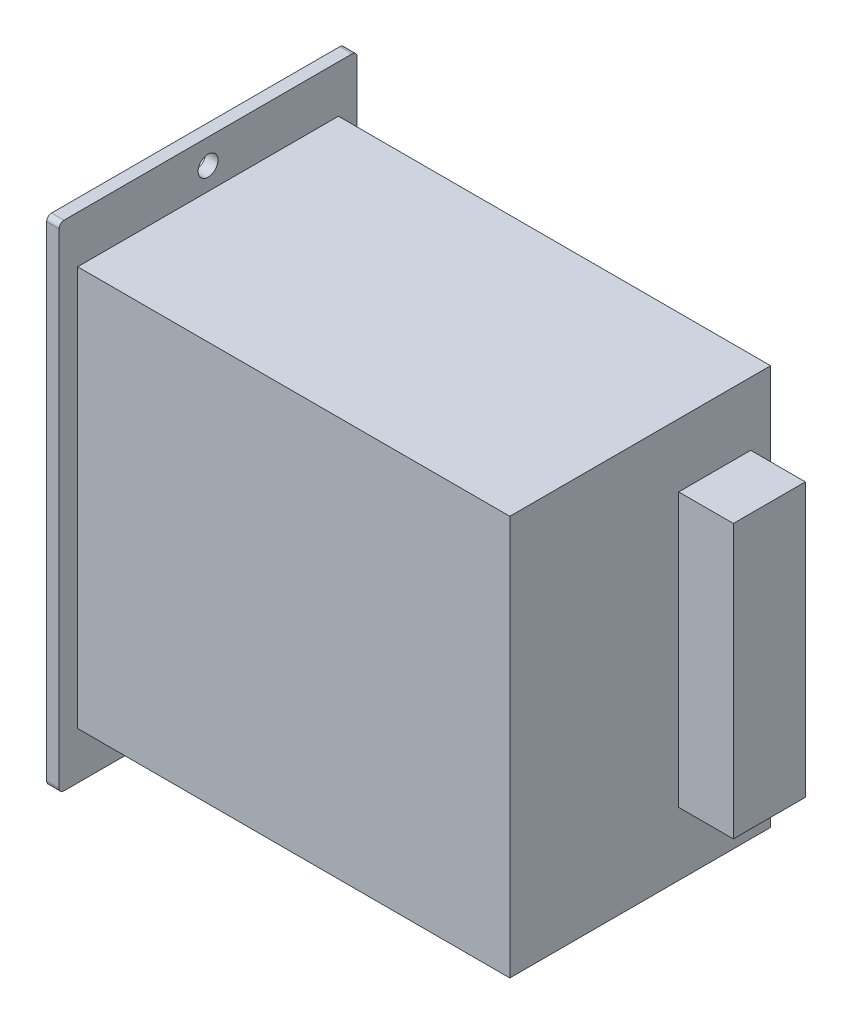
ISO-10303-21;
HEADER;
FILE_DESCRIPTION(('STEP AP214'),'2;1');
FILE_NAME('part.step','',(''),(''),'','','');
FILE_SCHEMA(('AUTOMOTIVE_DESIGN { 1 0 10303 214 1 1 1 1 }'));
ENDSEC;
DATA;
#1=APPLICATION_CONTEXT('core data for automotive mechanical design processes');
#2=APPLICATION_PROTOCOL_DEFINITION('international standard','automotive_design',2000,#1);
#3=PRODUCT_CONTEXT('',#1,'mechanical');
#4=PRODUCT('Part','Part','',(#3));
#5=PRODUCT_RELATED_PRODUCT_CATEGORY('part','',(#4));
#6=PRODUCT_DEFINITION_FORMATION('','',#4);
#7=PRODUCT_DEFINITION_CONTEXT('part definition',#1,'design');
#8=PRODUCT_DEFINITION('design','',#6,#7);
#9=PRODUCT_DEFINITION_SHAPE('','',#8);
#10=(LENGTH_UNIT() NAMED_UNIT(*) SI_UNIT(.MILLI.,.METRE.));
#11=(NAMED_UNIT(*) PLANE_ANGLE_UNIT() SI_UNIT($,.RADIAN.));
#12=(NAMED_UNIT(*) SI_UNIT($,.STERADIAN.) SOLID_ANGLE_UNIT());
#13=UNCERTAINTY_MEASURE_WITH_UNIT(LENGTH_MEASURE(1.E-05),#10,'distance_accuracy_value','');
#14=(GEOMETRIC_REPRESENTATION_CONTEXT(3) GLOBAL_UNCERTAINTY_ASSIGNED_CONTEXT((#13)) GLOBAL_UNIT_ASSIGNED_CONTEXT((#10,
#11,#12)) REPRESENTATION_CONTEXT('',''));
#15=CARTESIAN_POINT('',(0.,0.,0.));
#16=DIRECTION('',(0.,0.,1.));
#17=DIRECTION('',(1.,0.,0.));
#18=AXIS2_PLACEMENT_3D('',#15,#16,#17);
#19=CARTESIAN_POINT('',(0.,0.,0.));
#20=DIRECTION('',(-1.,0.,0.));
#21=DIRECTION('',(0.,0.,1.));
#22=AXIS2_PLACEMENT_3D('',#19,#20,#21);
#23=PLANE('',#22);
#24=CARTESIAN_POINT('',(0.,-44.75,0.));
#25=DIRECTION('',(-1.,0.,0.));
#26=DIRECTION('',(0.,0.,1.));
#27=AXIS2_PLACEMENT_3D('',#24,#25,#26);
#28=CIRCLE('',#27,2.5);
#29=CARTESIAN_POINT('',(0.,-44.75,2.5));
#30=VERTEX_POINT('',#29);
#31=EDGE_CURVE('E343',#30,#30,#28,.T.);
#32=ORIENTED_EDGE('',*,*,#31,.F.);
#33=EDGE_LOOP('',(#32));
#34=FACE_BOUND('',#33,.T.);
#35=CARTESIAN_POINT('',(0.,44.75,0.));
#36=DIRECTION('',(-1.,0.,0.));
#37=DIRECTION('',(0.,0.,1.));
#38=AXIS2_PLACEMENT_3D('',#35,#36,#37);
#39=CIRCLE('',#38,2.);
#40=CARTESIAN_POINT('',(0.,44.75,2.));
#41=VERTEX_POINT('',#40);
#42=EDGE_CURVE('E202',#41,#41,#39,.T.);
#43=ORIENTED_EDGE('',*,*,#42,.F.);
#44=EDGE_LOOP('',(#43));
#45=FACE_BOUND('',#44,.T.);
#46=DIRECTION('',(0.,1.,0.));
#47=VECTOR('',#46,1.);
#48=CARTESIAN_POINT('',(0.,-49.75,-30.));
#49=LINE('',#48,#47);
#50=CARTESIAN_POINT('',(0.,-48.75,-30.));
#51=VERTEX_POINT('',#50);
#52=CARTESIAN_POINT('',(0.,48.75,-30.));
#53=VERTEX_POINT('',#52);
#54=EDGE_CURVE('E274',#51,#53,#49,.T.);
#55=ORIENTED_EDGE('',*,*,#54,.F.);
#56=CARTESIAN_POINT('',(0.,-48.75,-29.));
#57=DIRECTION('',(-1.,0.,0.));
#58=DIRECTION('',(0.,0.,1.));
#59=AXIS2_PLACEMENT_3D('',#56,#57,#58);
#60=CIRCLE('',#59,1.);
#61=CARTESIAN_POINT('',(0.,-49.75,-29.));
#62=VERTEX_POINT('',#61);
#63=EDGE_CURVE('E317',#51,#62,#60,.T.);
#64=ORIENTED_EDGE('',*,*,#63,.T.);
#65=DIRECTION('',(0.,0.,-1.));
#66=VECTOR('',#65,1.);
#67=CARTESIAN_POINT('',(0.,-49.75,30.));
#68=LINE('',#67,#66);
#69=CARTESIAN_POINT('',(0.,-49.75,29.));
#70=VERTEX_POINT('',#69);
#71=EDGE_CURVE('E279',#70,#62,#68,.T.);
#72=ORIENTED_EDGE('',*,*,#71,.F.);
#73=CARTESIAN_POINT('',(0.,-48.75,29.));
#74=DIRECTION('',(-1.,0.,0.));
#75=DIRECTION('',(0.,0.,1.));
#76=AXIS2_PLACEMENT_3D('',#73,#74,#75);
#77=CIRCLE('',#76,1.);
#78=CARTESIAN_POINT('',(0.,-48.75,30.));
#79=VERTEX_POINT('',#78);
#80=EDGE_CURVE('E315',#70,#79,#77,.T.);
#81=ORIENTED_EDGE('',*,*,#80,.T.);
#82=DIRECTION('',(0.,-1.,0.));
#83=VECTOR('',#82,1.);
#84=CARTESIAN_POINT('',(0.,-49.75,30.));
#85=LINE('',#84,#83);
#86=CARTESIAN_POINT('',(0.,48.75,30.));
#87=VERTEX_POINT('',#86);
#88=EDGE_CURVE('E292',#87,#79,#85,.T.);
#89=ORIENTED_EDGE('',*,*,#88,.F.);
#90=CARTESIAN_POINT('',(0.,48.75,29.));
#91=DIRECTION('',(-1.,0.,0.));
#92=DIRECTION('',(0.,0.,1.));
#93=AXIS2_PLACEMENT_3D('',#90,#91,#92);
#94=CIRCLE('',#93,1.);
#95=CARTESIAN_POINT('',(0.,49.75,29.));
#96=VERTEX_POINT('',#95);
#97=EDGE_CURVE('E313',#87,#96,#94,.T.);
#98=ORIENTED_EDGE('',*,*,#97,.T.);
#99=DIRECTION('',(0.,0.,1.));
#100=VECTOR('',#99,1.);
#101=CARTESIAN_POINT('',(0.,49.75,30.));
#102=LINE('',#101,#100);
#103=CARTESIAN_POINT('',(0.,49.75,-29.));
#104=VERTEX_POINT('',#103);
#105=EDGE_CURVE('E289',#104,#96,#102,.T.);
#106=ORIENTED_EDGE('',*,*,#105,.F.);
#107=CARTESIAN_POINT('',(0.,48.75,-29.));
#108=DIRECTION('',(-1.,0.,0.));
#109=DIRECTION('',(0.,0.,1.));
#110=AXIS2_PLACEMENT_3D('',#107,#108,#109);
#111=CIRCLE('',#110,1.);
#112=EDGE_CURVE('E311',#104,#53,#111,.T.);
#113=ORIENTED_EDGE('',*,*,#112,.T.);
#114=EDGE_LOOP('',(#55,#64,#72,#81,#89,#98,#106,#113));
#115=FACE_BOUND('',#114,.T.);
#116=DIRECTION('',(0.,0.,-1.));
#117=VECTOR('',#116,1.);
#118=CARTESIAN_POINT('',(0.,40.25,-28.75));
#119=LINE('',#118,#117);
#120=CARTESIAN_POINT('',(0.,40.25,28.75));
#121=VERTEX_POINT('',#120);
#122=CARTESIAN_POINT('',(0.,40.25,-28.75));
#123=VERTEX_POINT('',#122);
#124=EDGE_CURVE('E174',#121,#123,#119,.T.);
#125=ORIENTED_EDGE('',*,*,#124,.F.);
#126=DIRECTION('',(0.,1.,0.));
#127=VECTOR('',#126,1.);
#128=CARTESIAN_POINT('',(0.,-40.25,28.75));
#129=LINE('',#128,#127);
#130=CARTESIAN_POINT('',(0.,-40.25,28.75));
#131=VERTEX_POINT('',#130);
#132=EDGE_CURVE('E178',#131,#121,#129,.T.);
#133=ORIENTED_EDGE('',*,*,#132,.F.);
#134=DIRECTION('',(0.,0.,1.));
#135=VECTOR('',#134,1.);
#136=CARTESIAN_POINT('',(0.,-40.25,-28.75));
#137=LINE('',#136,#135);
#138=CARTESIAN_POINT('',(0.,-40.25,-28.75));
#139=VERTEX_POINT('',#138);
#140=EDGE_CURVE('E206',#139,#131,#137,.T.);
#141=ORIENTED_EDGE('',*,*,#140,.F.);
#142=DIRECTION('',(0.,-1.,0.));
#143=VECTOR('',#142,1.);
#144=CARTESIAN_POINT('',(0.,-40.25,-28.75));
#145=LINE('',#144,#143);
#146=EDGE_CURVE('E181',#123,#139,#145,.T.);
#147=ORIENTED_EDGE('',*,*,#146,.F.);
#148=EDGE_LOOP('',(#125,#133,#141,#147));
#149=FACE_BOUND('',#148,.T.);
#150=ADVANCED_FACE('F35',(#34,#45,#115,#149),#23,.T.);
#151=CARTESIAN_POINT('',(89.5,0.,0.));
#152=DIRECTION('',(-1.,0.,0.));
#153=DIRECTION('',(0.,0.,1.));
#154=AXIS2_PLACEMENT_3D('',#151,#152,#153);
#155=PLANE('',#154);
#156=DIRECTION('',(0.,1.,0.));
#157=VECTOR('',#156,1.);
#158=CARTESIAN_POINT('',(89.5,-40.25,-26.25));
#159=LINE('',#158,#157);
#160=CARTESIAN_POINT('',(89.5,-40.25,-26.25));
#161=VERTEX_POINT('',#160);
#162=CARTESIAN_POINT('',(89.5,40.25,-26.25));
#163=VERTEX_POINT('',#162);
#164=EDGE_CURVE('E242',#161,#163,#159,.T.);
#165=ORIENTED_EDGE('',*,*,#164,.T.);
#166=DIRECTION('',(0.,0.,1.));
#167=VECTOR('',#166,1.);
#168=CARTESIAN_POINT('',(89.5,40.25,26.25));
#169=LINE('',#168,#167);
#170=CARTESIAN_POINT('',(89.5,40.25,26.25));
#171=VERTEX_POINT('',#170);
#172=EDGE_CURVE('E245',#163,#171,#169,.T.);
#173=ORIENTED_EDGE('',*,*,#172,.T.);
#174=DIRECTION('',(0.,-1.,0.));
#175=VECTOR('',#174,1.);
#176=CARTESIAN_POINT('',(89.5,-40.25,26.25));
#177=LINE('',#176,#175);
#178=CARTESIAN_POINT('',(89.5,-40.25,26.25));
#179=VERTEX_POINT('',#178);
#180=EDGE_CURVE('E248',#171,#179,#177,.T.);
#181=ORIENTED_EDGE('',*,*,#180,.T.);
#182=DIRECTION('',(0.,0.,-1.));
#183=VECTOR('',#182,1.);
#184=CARTESIAN_POINT('',(89.5,-40.25,26.25));
#185=LINE('',#184,#183);
#186=EDGE_CURVE('E250',#179,#161,#185,.T.);
#187=ORIENTED_EDGE('',*,*,#186,.T.);
#188=EDGE_LOOP('',(#165,#173,#181,#187));
#189=FACE_BOUND('',#188,.T.);
#190=DIRECTION('',(0.,1.,0.));
#191=VECTOR('',#190,1.);
#192=CARTESIAN_POINT('',(89.5,-27.5,-22.25));
#193=LINE('',#192,#191);
#194=CARTESIAN_POINT('',(89.5,-27.5,-22.25));
#195=VERTEX_POINT('',#194);
#196=CARTESIAN_POINT('',(89.5,27.5,-22.25));
#197=VERTEX_POINT('',#196);
#198=EDGE_CURVE('E208',#195,#197,#193,.T.);
#199=ORIENTED_EDGE('',*,*,#198,.F.);
#200=DIRECTION('',(0.,0.,-1.));
#201=VECTOR('',#200,1.);
#202=CARTESIAN_POINT('',(89.5,-27.5,-7.75000000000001));
#203=LINE('',#202,#201);
#204=CARTESIAN_POINT('',(89.5,-27.5,-7.75000000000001));
#205=VERTEX_POINT('',#204);
#206=EDGE_CURVE('E213',#205,#195,#203,.T.);
#207=ORIENTED_EDGE('',*,*,#206,.F.);
#208=DIRECTION('',(0.,-1.,0.));
#209=VECTOR('',#208,1.);
#210=CARTESIAN_POINT('',(89.5,27.5,-7.75));
#211=LINE('',#210,#209);
#212=CARTESIAN_POINT('',(89.5,27.5,-7.75));
#213=VERTEX_POINT('',#212);
#214=EDGE_CURVE('E225',#213,#205,#211,.T.);
#215=ORIENTED_EDGE('',*,*,#214,.F.);
#216=DIRECTION('',(0.,0.,1.));
#217=VECTOR('',#216,1.);
#218=CARTESIAN_POINT('',(89.5,27.5,-22.25));
#219=LINE('',#218,#217);
#220=EDGE_CURVE('E222',#197,#213,#219,.T.);
#221=ORIENTED_EDGE('',*,*,#220,.F.);
#222=EDGE_LOOP('',(#199,#207,#215,#221));
#223=FACE_BOUND('',#222,.T.);
#224=ADVANCED_FACE('F354',(#189,#223),#155,.F.);
#225=CARTESIAN_POINT('',(2.5,0.,0.));
#226=DIRECTION('',(-1.,0.,0.));
#227=DIRECTION('',(0.,0.,1.));
#228=AXIS2_PLACEMENT_3D('',#225,#226,#227);
#229=PLANE('',#228);
#230=CARTESIAN_POINT('',(2.5,-44.75,0.));
#231=DIRECTION('',(-1.,0.,0.));
#232=DIRECTION('',(0.,0.,1.));
#233=AXIS2_PLACEMENT_3D('',#230,#231,#232);
#234=CIRCLE('',#233,2.5);
#235=CARTESIAN_POINT('',(2.5,-44.75,2.5));
#236=VERTEX_POINT('',#235);
#237=EDGE_CURVE('E39',#236,#236,#234,.T.);
#238=ORIENTED_EDGE('',*,*,#237,.T.);
#239=EDGE_LOOP('',(#238));
#240=FACE_BOUND('',#239,.T.);
#241=CARTESIAN_POINT('',(2.5,44.75,0.));
#242=DIRECTION('',(-1.,0.,0.));
#243=DIRECTION('',(0.,0.,1.));
#244=AXIS2_PLACEMENT_3D('',#241,#242,#243);
#245=CIRCLE('',#244,2.);
#246=CARTESIAN_POINT('',(2.5,44.75,2.));
#247=VERTEX_POINT('',#246);
#248=EDGE_CURVE('E305',#247,#247,#245,.T.);
#249=ORIENTED_EDGE('',*,*,#248,.T.);
#250=EDGE_LOOP('',(#249));
#251=FACE_BOUND('',#250,.T.);
#252=DIRECTION('',(0.,0.,-1.));
#253=VECTOR('',#252,1.);
#254=CARTESIAN_POINT('',(2.5,-49.75,30.));
#255=LINE('',#254,#253);
#256=CARTESIAN_POINT('',(2.5,-49.75,29.));
#257=VERTEX_POINT('',#256);
#258=CARTESIAN_POINT('',(2.5,-49.75,-29.));
#259=VERTEX_POINT('',#258);
#260=EDGE_CURVE('E283',#257,#259,#255,.T.);
#261=ORIENTED_EDGE('',*,*,#260,.T.);
#262=CARTESIAN_POINT('',(2.5,-48.75,-29.));
#263=DIRECTION('',(-1.,0.,0.));
#264=DIRECTION('',(0.,0.,1.));
#265=AXIS2_PLACEMENT_3D('',#262,#263,#264);
#266=CIRCLE('',#265,1.);
#267=CARTESIAN_POINT('',(2.5,-48.75,-30.));
#268=VERTEX_POINT('',#267);
#269=EDGE_CURVE('E329',#259,#268,#266,.F.);
#270=ORIENTED_EDGE('',*,*,#269,.T.);
#271=DIRECTION('',(0.,1.,0.));
#272=VECTOR('',#271,1.);
#273=CARTESIAN_POINT('',(2.5,-49.75,-30.));
#274=LINE('',#273,#272);
#275=CARTESIAN_POINT('',(2.5,48.75,-30.));
#276=VERTEX_POINT('',#275);
#277=EDGE_CURVE('E275',#268,#276,#274,.T.);
#278=ORIENTED_EDGE('',*,*,#277,.T.);
#279=CARTESIAN_POINT('',(2.5,48.75,-29.));
#280=DIRECTION('',(-1.,0.,0.));
#281=DIRECTION('',(0.,0.,1.));
#282=AXIS2_PLACEMENT_3D('',#279,#280,#281);
#283=CIRCLE('',#282,1.);
#284=CARTESIAN_POINT('',(2.5,49.75,-29.));
#285=VERTEX_POINT('',#284);
#286=EDGE_CURVE('E324',#276,#285,#283,.F.);
#287=ORIENTED_EDGE('',*,*,#286,.T.);
#288=DIRECTION('',(0.,0.,1.));
#289=VECTOR('',#288,1.);
#290=CARTESIAN_POINT('',(2.5,49.75,30.));
#291=LINE('',#290,#289);
#292=CARTESIAN_POINT('',(2.5,49.75,29.));
#293=VERTEX_POINT('',#292);
#294=EDGE_CURVE('E278',#285,#293,#291,.T.);
#295=ORIENTED_EDGE('',*,*,#294,.T.);
#296=CARTESIAN_POINT('',(2.5,48.75,29.));
#297=DIRECTION('',(-1.,0.,0.));
#298=DIRECTION('',(0.,0.,1.));
#299=AXIS2_PLACEMENT_3D('',#296,#297,#298);
#300=CIRCLE('',#299,1.);
#301=CARTESIAN_POINT('',(2.5,48.75,30.));
#302=VERTEX_POINT('',#301);
#303=EDGE_CURVE('E59',#293,#302,#300,.F.);
#304=ORIENTED_EDGE('',*,*,#303,.T.);
#305=DIRECTION('',(0.,-1.,0.));
#306=VECTOR('',#305,1.);
#307=CARTESIAN_POINT('',(2.5,-49.75,30.));
#308=LINE('',#307,#306);
#309=CARTESIAN_POINT('',(2.5,-48.75,30.));
#310=VERTEX_POINT('',#309);
#311=EDGE_CURVE('E281',#302,#310,#308,.T.);
#312=ORIENTED_EDGE('',*,*,#311,.T.);
#313=CARTESIAN_POINT('',(2.5,-48.75,29.));
#314=DIRECTION('',(-1.,0.,0.));
#315=DIRECTION('',(0.,0.,1.));
#316=AXIS2_PLACEMENT_3D('',#313,#314,#315);
#317=CIRCLE('',#316,1.);
#318=EDGE_CURVE('E327',#310,#257,#317,.F.);
#319=ORIENTED_EDGE('',*,*,#318,.T.);
#320=EDGE_LOOP('',(#261,#270,#278,#287,#295,#304,#312,#319));
#321=FACE_BOUND('',#320,.T.);
#322=DIRECTION('',(0.,1.,0.));
#323=VECTOR('',#322,1.);
#324=CARTESIAN_POINT('',(2.5,-40.25,-26.25));
#325=LINE('',#324,#323);
#326=CARTESIAN_POINT('',(2.5,-40.25,-26.25));
#327=VERTEX_POINT('',#326);
#328=CARTESIAN_POINT('',(2.5,40.25,-26.25));
#329=VERTEX_POINT('',#328);
#330=EDGE_CURVE('E241',#327,#329,#325,.T.);
#331=ORIENTED_EDGE('',*,*,#330,.F.);
#332=DIRECTION('',(0.,0.,-1.));
#333=VECTOR('',#332,1.);
#334=CARTESIAN_POINT('',(2.5,-40.25,26.25));
#335=LINE('',#334,#333);
#336=CARTESIAN_POINT('',(2.5,-40.25,26.25));
#337=VERTEX_POINT('',#336);
#338=EDGE_CURVE('E246',#337,#327,#335,.T.);
#339=ORIENTED_EDGE('',*,*,#338,.F.);
#340=DIRECTION('',(0.,-1.,0.));
#341=VECTOR('',#340,1.);
#342=CARTESIAN_POINT('',(2.5,-40.25,26.25));
#343=LINE('',#342,#341);
#344=CARTESIAN_POINT('',(2.5,40.25,26.25));
#345=VERTEX_POINT('',#344);
#346=EDGE_CURVE('E258',#345,#337,#343,.T.);
#347=ORIENTED_EDGE('',*,*,#346,.F.);
#348=DIRECTION('',(0.,0.,1.));
#349=VECTOR('',#348,1.);
#350=CARTESIAN_POINT('',(2.5,40.25,26.25));
#351=LINE('',#350,#349);
#352=EDGE_CURVE('E255',#329,#345,#351,.T.);
#353=ORIENTED_EDGE('',*,*,#352,.F.);
#354=EDGE_LOOP('',(#331,#339,#347,#353));
#355=FACE_BOUND('',#354,.T.);
#356=ADVANCED_FACE('F369',(#240,#251,#321,#355),#229,.F.);
#357=CARTESIAN_POINT('',(2.5,-49.75,-30.));
#358=DIRECTION('',(0.,0.,1.));
#359=DIRECTION('',(1.,0.,0.));
#360=AXIS2_PLACEMENT_3D('',#357,#358,#359);
#361=PLANE('',#360);
#362=ORIENTED_EDGE('',*,*,#277,.F.);
#363=DIRECTION('',(-1.,0.,0.));
#364=VECTOR('',#363,1.);
#365=CARTESIAN_POINT('',(2.5,-48.75,-30.));
#366=LINE('',#365,#364);
#367=EDGE_CURVE('E308',#268,#51,#366,.T.);
#368=ORIENTED_EDGE('',*,*,#367,.T.);
#369=ORIENTED_EDGE('',*,*,#54,.T.);
#370=DIRECTION('',(-1.,0.,0.));
#371=VECTOR('',#370,1.);
#372=CARTESIAN_POINT('',(2.5,48.75,-30.));
#373=LINE('',#372,#371);
#374=EDGE_CURVE('E303',#53,#276,#373,.F.);
#375=ORIENTED_EDGE('',*,*,#374,.T.);
#376=EDGE_LOOP('',(#362,#368,#369,#375));
#377=FACE_BOUND('',#376,.T.);
#378=ADVANCED_FACE('F363',(#377),#361,.F.);
#379=CARTESIAN_POINT('',(2.5,49.75,30.));
#380=DIRECTION('',(0.,-1.,0.));
#381=DIRECTION('',(0.,0.,-1.));
#382=AXIS2_PLACEMENT_3D('',#379,#380,#381);
#383=PLANE('',#382);
#384=ORIENTED_EDGE('',*,*,#105,.T.);
#385=DIRECTION('',(-1.,0.,0.));
#386=VECTOR('',#385,1.);
#387=CARTESIAN_POINT('',(2.5,49.75,29.));
#388=LINE('',#387,#386);
#389=EDGE_CURVE('E11',#96,#293,#388,.F.);
#390=ORIENTED_EDGE('',*,*,#389,.T.);
#391=ORIENTED_EDGE('',*,*,#294,.F.);
#392=DIRECTION('',(-1.,0.,0.));
#393=VECTOR('',#392,1.);
#394=CARTESIAN_POINT('',(2.5,49.75,-29.));
#395=LINE('',#394,#393);
#396=EDGE_CURVE('E44',#285,#104,#395,.T.);
#397=ORIENTED_EDGE('',*,*,#396,.T.);
#398=EDGE_LOOP('',(#384,#390,#391,#397));
#399=FACE_BOUND('',#398,.T.);
#400=ADVANCED_FACE('F372',(#399),#383,.F.);
#401=CARTESIAN_POINT('',(2.5,-49.75,30.));
#402=DIRECTION('',(0.,0.,-1.));
#403=DIRECTION('',(-1.,0.,0.));
#404=AXIS2_PLACEMENT_3D('',#401,#402,#403);
#405=PLANE('',#404);
#406=ORIENTED_EDGE('',*,*,#88,.T.);
#407=DIRECTION('',(-1.,0.,0.));
#408=VECTOR('',#407,1.);
#409=CARTESIAN_POINT('',(2.5,-48.75,30.));
#410=LINE('',#409,#408);
#411=EDGE_CURVE('E52',#79,#310,#410,.F.);
#412=ORIENTED_EDGE('',*,*,#411,.T.);
#413=ORIENTED_EDGE('',*,*,#311,.F.);
#414=DIRECTION('',(-1.,0.,0.));
#415=VECTOR('',#414,1.);
#416=CARTESIAN_POINT('',(2.5,48.75,30.));
#417=LINE('',#416,#415);
#418=EDGE_CURVE('E331',#302,#87,#417,.T.);
#419=ORIENTED_EDGE('',*,*,#418,.T.);
#420=EDGE_LOOP('',(#406,#412,#413,#419));
#421=FACE_BOUND('',#420,.T.);
#422=ADVANCED_FACE('F378',(#421),#405,.F.);
#423=CARTESIAN_POINT('',(2.5,-49.75,30.));
#424=DIRECTION('',(0.,1.,0.));
#425=DIRECTION('',(0.,0.,1.));
#426=AXIS2_PLACEMENT_3D('',#423,#424,#425);
#427=PLANE('',#426);
#428=ORIENTED_EDGE('',*,*,#71,.T.);
#429=DIRECTION('',(-1.,0.,0.));
#430=VECTOR('',#429,1.);
#431=CARTESIAN_POINT('',(2.5,-49.75,-29.));
#432=LINE('',#431,#430);
#433=EDGE_CURVE('E322',#62,#259,#432,.F.);
#434=ORIENTED_EDGE('',*,*,#433,.T.);
#435=ORIENTED_EDGE('',*,*,#260,.F.);
#436=DIRECTION('',(-1.,0.,0.));
#437=VECTOR('',#436,1.);
#438=CARTESIAN_POINT('',(2.5,-49.75,29.));
#439=LINE('',#438,#437);
#440=EDGE_CURVE('E319',#257,#70,#439,.T.);
#441=ORIENTED_EDGE('',*,*,#440,.T.);
#442=EDGE_LOOP('',(#428,#434,#435,#441));
#443=FACE_BOUND('',#442,.T.);
#444=ADVANCED_FACE('F385',(#443),#427,.F.);
#445=CARTESIAN_POINT('',(89.5,-40.25,-26.25));
#446=DIRECTION('',(0.,0.,1.));
#447=DIRECTION('',(1.,0.,0.));
#448=AXIS2_PLACEMENT_3D('',#445,#446,#447);
#449=PLANE('',#448);
#450=ORIENTED_EDGE('',*,*,#330,.T.);
#451=DIRECTION('',(-1.,0.,0.));
#452=VECTOR('',#451,1.);
#453=CARTESIAN_POINT('',(89.5,40.25,-26.25));
#454=LINE('',#453,#452);
#455=EDGE_CURVE('E271',#163,#329,#454,.T.);
#456=ORIENTED_EDGE('',*,*,#455,.F.);
#457=ORIENTED_EDGE('',*,*,#164,.F.);
#458=DIRECTION('',(-1.,0.,0.));
#459=VECTOR('',#458,1.);
#460=CARTESIAN_POINT('',(89.5,-40.25,-26.25));
#461=LINE('',#460,#459);
#462=EDGE_CURVE('E252',#161,#327,#461,.T.);
#463=ORIENTED_EDGE('',*,*,#462,.T.);
#464=EDGE_LOOP('',(#450,#456,#457,#463));
#465=FACE_BOUND('',#464,.T.);
#466=ADVANCED_FACE('F455',(#465),#449,.F.);
#467=CARTESIAN_POINT('',(89.5,40.25,26.25));
#468=DIRECTION('',(0.,-1.,0.));
#469=DIRECTION('',(0.,0.,-1.));
#470=AXIS2_PLACEMENT_3D('',#467,#468,#469);
#471=PLANE('',#470);
#472=ORIENTED_EDGE('',*,*,#352,.T.);
#473=DIRECTION('',(-1.,0.,0.));
#474=VECTOR('',#473,1.);
#475=CARTESIAN_POINT('',(89.5,40.25,26.25));
#476=LINE('',#475,#474);
#477=EDGE_CURVE('E268',#171,#345,#476,.T.);
#478=ORIENTED_EDGE('',*,*,#477,.F.);
#479=ORIENTED_EDGE('',*,*,#172,.F.);
#480=ORIENTED_EDGE('',*,*,#455,.T.);
#481=EDGE_LOOP('',(#472,#478,#479,#480));
#482=FACE_BOUND('',#481,.T.);
#483=ADVANCED_FACE('F451',(#482),#471,.F.);
#484=CARTESIAN_POINT('',(89.5,-40.25,26.25));
#485=DIRECTION('',(0.,0.,-1.));
#486=DIRECTION('',(-1.,0.,0.));
#487=AXIS2_PLACEMENT_3D('',#484,#485,#486);
#488=PLANE('',#487);
#489=ORIENTED_EDGE('',*,*,#346,.T.);
#490=DIRECTION('',(-1.,0.,0.));
#491=VECTOR('',#490,1.);
#492=CARTESIAN_POINT('',(89.5,-40.25,26.25));
#493=LINE('',#492,#491);
#494=EDGE_CURVE('E265',#179,#337,#493,.T.);
#495=ORIENTED_EDGE('',*,*,#494,.F.);
#496=ORIENTED_EDGE('',*,*,#180,.F.);
#497=ORIENTED_EDGE('',*,*,#477,.T.);
#498=EDGE_LOOP('',(#489,#495,#496,#497));
#499=FACE_BOUND('',#498,.T.);
#500=ADVANCED_FACE('F447',(#499),#488,.F.);
#501=CARTESIAN_POINT('',(89.5,-40.25,26.25));
#502=DIRECTION('',(0.,1.,0.));
#503=DIRECTION('',(0.,0.,1.));
#504=AXIS2_PLACEMENT_3D('',#501,#502,#503);
#505=PLANE('',#504);
#506=ORIENTED_EDGE('',*,*,#338,.T.);
#507=ORIENTED_EDGE('',*,*,#462,.F.);
#508=ORIENTED_EDGE('',*,*,#186,.F.);
#509=ORIENTED_EDGE('',*,*,#494,.T.);
#510=EDGE_LOOP('',(#506,#507,#508,#509));
#511=FACE_BOUND('',#510,.T.);
#512=ADVANCED_FACE('F440',(#511),#505,.F.);
#513=CARTESIAN_POINT('',(100.5,-27.5,-22.25));
#514=DIRECTION('',(0.,0.,1.));
#515=DIRECTION('',(1.,0.,0.));
#516=AXIS2_PLACEMENT_3D('',#513,#514,#515);
#517=PLANE('',#516);
#518=ORIENTED_EDGE('',*,*,#198,.T.);
#519=DIRECTION('',(-1.,0.,0.));
#520=VECTOR('',#519,1.);
#521=CARTESIAN_POINT('',(100.5,27.5,-22.25));
#522=LINE('',#521,#520);
#523=CARTESIAN_POINT('',(100.5,27.5,-22.25));
#524=VERTEX_POINT('',#523);
#525=EDGE_CURVE('E238',#524,#197,#522,.T.);
#526=ORIENTED_EDGE('',*,*,#525,.F.);
#527=DIRECTION('',(0.,1.,0.));
#528=VECTOR('',#527,1.);
#529=CARTESIAN_POINT('',(100.5,-27.5,-22.25));
#530=LINE('',#529,#528);
#531=CARTESIAN_POINT('',(100.5,-27.5,-22.25));
#532=VERTEX_POINT('',#531);
#533=EDGE_CURVE('E209',#532,#524,#530,.T.);
#534=ORIENTED_EDGE('',*,*,#533,.F.);
#535=DIRECTION('',(-1.,0.,0.));
#536=VECTOR('',#535,1.);
#537=CARTESIAN_POINT('',(100.5,-27.5,-22.25));
#538=LINE('',#537,#536);
#539=EDGE_CURVE('E219',#532,#195,#538,.T.);
#540=ORIENTED_EDGE('',*,*,#539,.T.);
#541=EDGE_LOOP('',(#518,#526,#534,#540));
#542=FACE_BOUND('',#541,.T.);
#543=ADVANCED_FACE('F436',(#542),#517,.F.);
#544=CARTESIAN_POINT('',(100.5,27.5,-22.25));
#545=DIRECTION('',(0.,-1.,0.));
#546=DIRECTION('',(0.,0.,-1.));
#547=AXIS2_PLACEMENT_3D('',#544,#545,#546);
#548=PLANE('',#547);
#549=ORIENTED_EDGE('',*,*,#220,.T.);
#550=DIRECTION('',(-1.,0.,0.));
#551=VECTOR('',#550,1.);
#552=CARTESIAN_POINT('',(100.5,27.5,-7.75));
#553=LINE('',#552,#551);
#554=CARTESIAN_POINT('',(100.5,27.5,-7.75));
#555=VERTEX_POINT('',#554);
#556=EDGE_CURVE('E235',#555,#213,#553,.T.);
#557=ORIENTED_EDGE('',*,*,#556,.F.);
#558=DIRECTION('',(0.,0.,1.));
#559=VECTOR('',#558,1.);
#560=CARTESIAN_POINT('',(100.5,27.5,-22.25));
#561=LINE('',#560,#559);
#562=EDGE_CURVE('E212',#524,#555,#561,.T.);
#563=ORIENTED_EDGE('',*,*,#562,.F.);
#564=ORIENTED_EDGE('',*,*,#525,.T.);
#565=EDGE_LOOP('',(#549,#557,#563,#564));
#566=FACE_BOUND('',#565,.T.);
#567=ADVANCED_FACE('F432',(#566),#548,.F.);
#568=CARTESIAN_POINT('',(100.5,27.5,-7.75));
#569=DIRECTION('',(0.,0.,-1.));
#570=DIRECTION('',(0.,1.,0.));
#571=AXIS2_PLACEMENT_3D('',#568,#569,#570);
#572=PLANE('',#571);
#573=ORIENTED_EDGE('',*,*,#214,.T.);
#574=DIRECTION('',(-1.,0.,0.));
#575=VECTOR('',#574,1.);
#576=CARTESIAN_POINT('',(100.5,-27.5,-7.75000000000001));
#577=LINE('',#576,#575);
#578=CARTESIAN_POINT('',(100.5,-27.5,-7.75000000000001));
#579=VERTEX_POINT('',#578);
#580=EDGE_CURVE('E232',#579,#205,#577,.T.);
#581=ORIENTED_EDGE('',*,*,#580,.F.);
#582=DIRECTION('',(0.,-1.,0.));
#583=VECTOR('',#582,1.);
#584=CARTESIAN_POINT('',(100.5,27.5,-7.75));
#585=LINE('',#584,#583);
#586=EDGE_CURVE('E215',#555,#579,#585,.T.);
#587=ORIENTED_EDGE('',*,*,#586,.F.);
#588=ORIENTED_EDGE('',*,*,#556,.T.);
#589=EDGE_LOOP('',(#573,#581,#587,#588));
#590=FACE_BOUND('',#589,.T.);
#591=ADVANCED_FACE('F428',(#590),#572,.F.);
#592=CARTESIAN_POINT('',(100.5,-27.5,-7.75000000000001));
#593=DIRECTION('',(0.,1.,0.));
#594=DIRECTION('',(0.,0.,1.));
#595=AXIS2_PLACEMENT_3D('',#592,#593,#594);
#596=PLANE('',#595);
#597=ORIENTED_EDGE('',*,*,#206,.T.);
#598=ORIENTED_EDGE('',*,*,#539,.F.);
#599=DIRECTION('',(0.,0.,-1.));
#600=VECTOR('',#599,1.);
#601=CARTESIAN_POINT('',(100.5,-27.5,-7.75000000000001));
#602=LINE('',#601,#600);
#603=EDGE_CURVE('E217',#579,#532,#602,.T.);
#604=ORIENTED_EDGE('',*,*,#603,.F.);
#605=ORIENTED_EDGE('',*,*,#580,.T.);
#606=EDGE_LOOP('',(#597,#598,#604,#605));
#607=FACE_BOUND('',#606,.T.);
#608=ADVANCED_FACE('F424',(#607),#596,.F.);
#609=CARTESIAN_POINT('',(100.5,0.,0.));
#610=DIRECTION('',(1.,0.,0.));
#611=DIRECTION('',(0.,0.,-1.));
#612=AXIS2_PLACEMENT_3D('',#609,#610,#611);
#613=PLANE('',#612);
#614=ORIENTED_EDGE('',*,*,#533,.T.);
#615=ORIENTED_EDGE('',*,*,#562,.T.);
#616=ORIENTED_EDGE('',*,*,#586,.T.);
#617=ORIENTED_EDGE('',*,*,#603,.T.);
#618=EDGE_LOOP('',(#614,#615,#616,#617));
#619=FACE_BOUND('',#618,.T.);
#620=ADVANCED_FACE('F420',(#619),#613,.T.);
#621=CARTESIAN_POINT('',(-1.,0.,0.));
#622=DIRECTION('',(1.,0.,0.));
#623=DIRECTION('',(0.,0.,-1.));
#624=AXIS2_PLACEMENT_3D('',#621,#622,#623);
#625=PLANE('',#624);
#626=DIRECTION('',(0.,-1.,0.));
#627=VECTOR('',#626,1.);
#628=CARTESIAN_POINT('',(-1.,0.,-27.75));
#629=LINE('',#628,#627);
#630=CARTESIAN_POINT('',(-1.,39.25,-27.75));
#631=VERTEX_POINT('',#630);
#632=CARTESIAN_POINT('',(-1.,-39.25,-27.75));
#633=VERTEX_POINT('',#632);
#634=EDGE_CURVE('E298',#631,#633,#629,.T.);
#635=ORIENTED_EDGE('',*,*,#634,.T.);
#636=DIRECTION('',(0.,0.,1.));
#637=VECTOR('',#636,1.);
#638=CARTESIAN_POINT('',(-1.,-39.25,0.));
#639=LINE('',#638,#637);
#640=CARTESIAN_POINT('',(-1.,-39.25,27.75));
#641=VERTEX_POINT('',#640);
#642=EDGE_CURVE('E300',#633,#641,#639,.T.);
#643=ORIENTED_EDGE('',*,*,#642,.T.);
#644=DIRECTION('',(0.,1.,0.));
#645=VECTOR('',#644,1.);
#646=CARTESIAN_POINT('',(-1.,0.,27.75));
#647=LINE('',#646,#645);
#648=CARTESIAN_POINT('',(-1.,39.25,27.75));
#649=VERTEX_POINT('',#648);
#650=EDGE_CURVE('E286',#641,#649,#647,.T.);
#651=ORIENTED_EDGE('',*,*,#650,.T.);
#652=DIRECTION('',(0.,0.,-1.));
#653=VECTOR('',#652,1.);
#654=CARTESIAN_POINT('',(-1.,39.25,0.));
#655=LINE('',#654,#653);
#656=EDGE_CURVE('E190',#649,#631,#655,.T.);
#657=ORIENTED_EDGE('',*,*,#656,.T.);
#658=EDGE_LOOP('',(#635,#643,#651,#657));
#659=FACE_BOUND('',#658,.T.);
#660=ADVANCED_FACE('F417',(#659),#625,.F.);
#661=CARTESIAN_POINT('',(-1.,39.25,0.));
#662=DIRECTION('',(0.707106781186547,-0.707106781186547,0.));
#663=DIRECTION('',(0.,0.,-1.));
#664=AXIS2_PLACEMENT_3D('',#661,#662,#663);
#665=PLANE('',#664);
#666=DIRECTION('',(-0.577350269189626,-0.577350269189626,-0.577350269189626));
#667=VECTOR('',#666,1.);
#668=CARTESIAN_POINT('',(-14.0833333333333,26.1666666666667,14.6666666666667));
#669=LINE('',#668,#667);
#670=EDGE_CURVE('E188',#121,#649,#669,.T.);
#671=ORIENTED_EDGE('',*,*,#670,.F.);
#672=ORIENTED_EDGE('',*,*,#124,.T.);
#673=DIRECTION('',(-0.577350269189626,-0.577350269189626,0.577350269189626));
#674=VECTOR('',#673,1.);
#675=CARTESIAN_POINT('',(-10.25,30.,-18.5));
#676=LINE('',#675,#674);
#677=EDGE_CURVE('E193',#631,#123,#676,.F.);
#678=ORIENTED_EDGE('',*,*,#677,.F.);
#679=ORIENTED_EDGE('',*,*,#656,.F.);
#680=EDGE_LOOP('',(#671,#672,#678,#679));
#681=FACE_BOUND('',#680,.T.);
#682=ADVANCED_FACE('F189',(#681),#665,.F.);
#683=CARTESIAN_POINT('',(-1.,0.,-27.75));
#684=DIRECTION('',(0.707106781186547,0.,0.707106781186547));
#685=DIRECTION('',(0.,-1.,0.));
#686=AXIS2_PLACEMENT_3D('',#683,#684,#685);
#687=PLANE('',#686);
#688=ORIENTED_EDGE('',*,*,#677,.T.);
#689=ORIENTED_EDGE('',*,*,#146,.T.);
#690=DIRECTION('',(-0.577350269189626,0.577350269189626,0.577350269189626));
#691=VECTOR('',#690,1.);
#692=CARTESIAN_POINT('',(-14.0833333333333,-26.1666666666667,-14.6666666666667));
#693=LINE('',#692,#691);
#694=EDGE_CURVE('E194',#633,#139,#693,.F.);
#695=ORIENTED_EDGE('',*,*,#694,.F.);
#696=ORIENTED_EDGE('',*,*,#634,.F.);
#697=EDGE_LOOP('',(#688,#689,#695,#696));
#698=FACE_BOUND('',#697,.T.);
#699=ADVANCED_FACE('F471',(#698),#687,.F.);
#700=CARTESIAN_POINT('',(-1.,0.,27.75));
#701=DIRECTION('',(0.707106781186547,0.,-0.707106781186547));
#702=DIRECTION('',(0.,1.,0.));
#703=AXIS2_PLACEMENT_3D('',#700,#701,#702);
#704=PLANE('',#703);
#705=ORIENTED_EDGE('',*,*,#670,.T.);
#706=ORIENTED_EDGE('',*,*,#650,.F.);
#707=DIRECTION('',(0.577350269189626,-0.577350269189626,0.577350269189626));
#708=VECTOR('',#707,1.);
#709=CARTESIAN_POINT('',(-14.0833333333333,-26.1666666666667,14.6666666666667));
#710=LINE('',#709,#708);
#711=EDGE_CURVE('E198',#131,#641,#710,.F.);
#712=ORIENTED_EDGE('',*,*,#711,.F.);
#713=ORIENTED_EDGE('',*,*,#132,.T.);
#714=EDGE_LOOP('',(#705,#706,#712,#713));
#715=FACE_BOUND('',#714,.T.);
#716=ADVANCED_FACE('F197',(#715),#704,.F.);
#717=CARTESIAN_POINT('',(-1.,-39.25,0.));
#718=DIRECTION('',(0.707106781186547,0.707106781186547,0.));
#719=DIRECTION('',(0.,0.,1.));
#720=AXIS2_PLACEMENT_3D('',#717,#718,#719);
#721=PLANE('',#720);
#722=ORIENTED_EDGE('',*,*,#694,.T.);
#723=ORIENTED_EDGE('',*,*,#140,.T.);
#724=ORIENTED_EDGE('',*,*,#711,.T.);
#725=ORIENTED_EDGE('',*,*,#642,.F.);
#726=EDGE_LOOP('',(#722,#723,#724,#725));
#727=FACE_BOUND('',#726,.T.);
#728=ADVANCED_FACE('F391',(#727),#721,.F.);
#729=CARTESIAN_POINT('',(2.5,-48.75,-29.));
#730=DIRECTION('',(-1.,0.,0.));
#731=DIRECTION('',(0.,0.,1.));
#732=AXIS2_PLACEMENT_3D('',#729,#730,#731);
#733=CYLINDRICAL_SURFACE('',#732,1.);
#734=ORIENTED_EDGE('',*,*,#269,.F.);
#735=ORIENTED_EDGE('',*,*,#433,.F.);
#736=ORIENTED_EDGE('',*,*,#63,.F.);
#737=ORIENTED_EDGE('',*,*,#367,.F.);
#738=EDGE_LOOP('',(#734,#735,#736,#737));
#739=FACE_BOUND('',#738,.T.);
#740=ADVANCED_FACE('F389',(#739),#733,.T.);
#741=CARTESIAN_POINT('',(2.5,-48.75,29.));
#742=DIRECTION('',(-1.,0.,0.));
#743=DIRECTION('',(0.,0.,1.));
#744=AXIS2_PLACEMENT_3D('',#741,#742,#743);
#745=CYLINDRICAL_SURFACE('',#744,1.);
#746=ORIENTED_EDGE('',*,*,#318,.F.);
#747=ORIENTED_EDGE('',*,*,#411,.F.);
#748=ORIENTED_EDGE('',*,*,#80,.F.);
#749=ORIENTED_EDGE('',*,*,#440,.F.);
#750=EDGE_LOOP('',(#746,#747,#748,#749));
#751=FACE_BOUND('',#750,.T.);
#752=ADVANCED_FACE('F382',(#751),#745,.T.);
#753=CARTESIAN_POINT('',(2.5,48.75,29.));
#754=DIRECTION('',(-1.,0.,0.));
#755=DIRECTION('',(0.,0.,1.));
#756=AXIS2_PLACEMENT_3D('',#753,#754,#755);
#757=CYLINDRICAL_SURFACE('',#756,1.);
#758=ORIENTED_EDGE('',*,*,#303,.F.);
#759=ORIENTED_EDGE('',*,*,#389,.F.);
#760=ORIENTED_EDGE('',*,*,#97,.F.);
#761=ORIENTED_EDGE('',*,*,#418,.F.);
#762=EDGE_LOOP('',(#758,#759,#760,#761));
#763=FACE_BOUND('',#762,.T.);
#764=ADVANCED_FACE('F375',(#763),#757,.T.);
#765=CARTESIAN_POINT('',(2.5,48.75,-29.));
#766=DIRECTION('',(-1.,0.,0.));
#767=DIRECTION('',(0.,0.,1.));
#768=AXIS2_PLACEMENT_3D('',#765,#766,#767);
#769=CYLINDRICAL_SURFACE('',#768,1.);
#770=ORIENTED_EDGE('',*,*,#286,.F.);
#771=ORIENTED_EDGE('',*,*,#374,.F.);
#772=ORIENTED_EDGE('',*,*,#112,.F.);
#773=ORIENTED_EDGE('',*,*,#396,.F.);
#774=EDGE_LOOP('',(#770,#771,#772,#773));
#775=FACE_BOUND('',#774,.T.);
#776=ADVANCED_FACE('F37',(#775),#769,.T.);
#777=CARTESIAN_POINT('',(3.,44.75,0.));
#778=DIRECTION('',(-1.,0.,0.));
#779=DIRECTION('',(0.,0.,1.));
#780=AXIS2_PLACEMENT_3D('',#777,#778,#779);
#781=CYLINDRICAL_SURFACE('',#780,2.);
#782=ORIENTED_EDGE('',*,*,#42,.T.);
#783=EDGE_LOOP('',(#782));
#784=FACE_BOUND('',#783,.T.);
#785=ORIENTED_EDGE('',*,*,#248,.F.);
#786=EDGE_LOOP('',(#785));
#787=FACE_BOUND('',#786,.T.);
#788=ADVANCED_FACE('F406',(#784,#787),#781,.F.);
#789=CARTESIAN_POINT('',(3.,-44.75,0.));
#790=DIRECTION('',(-1.,0.,0.));
#791=DIRECTION('',(0.,0.,1.));
#792=AXIS2_PLACEMENT_3D('',#789,#790,#791);
#793=CYLINDRICAL_SURFACE('',#792,2.5);
#794=ORIENTED_EDGE('',*,*,#31,.T.);
#795=EDGE_LOOP('',(#794));
#796=FACE_BOUND('',#795,.T.);
#797=ORIENTED_EDGE('',*,*,#237,.F.);
#798=EDGE_LOOP('',(#797));
#799=FACE_BOUND('',#798,.T.);
#800=ADVANCED_FACE('F349',(#796,#799),#793,.F.);
#801=CLOSED_SHELL('',(#150,#224,#356,#378,#400,#422,#444,#466,#483,#500,#512,#543,#567,#591,
#608,#620,#660,#682,#699,#716,#728,#740,#752,#764,#776,#788,#800));
#802=MANIFOLD_SOLID_BREP('B2',#801);
#803=ADVANCED_BREP_SHAPE_REPRESENTATION('',(#18,#802),#14);
#804=SHAPE_DEFINITION_REPRESENTATION(#9,#803);
ENDSEC;
END-ISO-10303-21;
